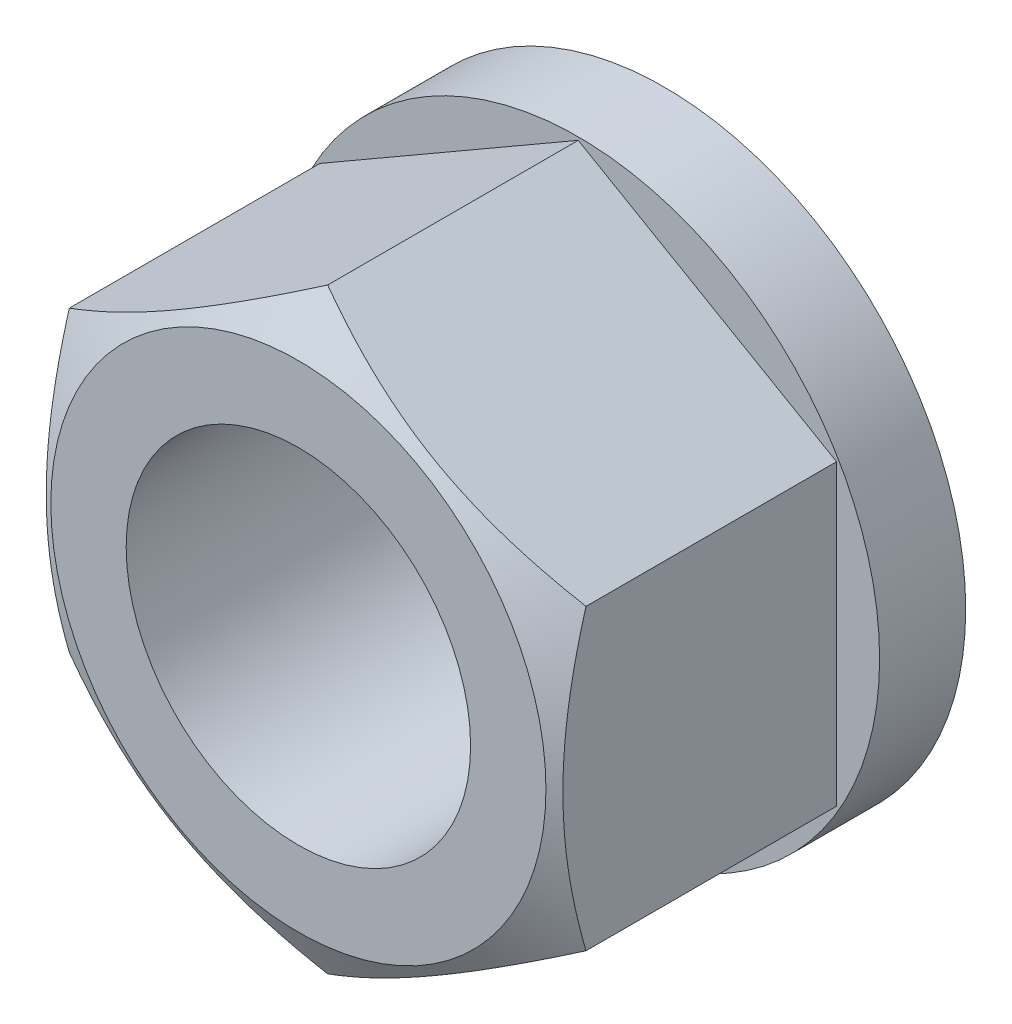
ISO-10303-21;
HEADER;
FILE_DESCRIPTION(('STEP AP214'),'2;1');
FILE_NAME('part.step','',(''),(''),'','','');
FILE_SCHEMA(('AUTOMOTIVE_DESIGN { 1 0 10303 214 1 1 1 1 }'));
ENDSEC;
DATA;
#1=APPLICATION_CONTEXT('core data for automotive mechanical design processes');
#2=APPLICATION_PROTOCOL_DEFINITION('international standard','automotive_design',2000,#1);
#3=PRODUCT_CONTEXT('',#1,'mechanical');
#4=PRODUCT('Part','Part','',(#3));
#5=PRODUCT_RELATED_PRODUCT_CATEGORY('part','',(#4));
#6=PRODUCT_DEFINITION_FORMATION('','',#4);
#7=PRODUCT_DEFINITION_CONTEXT('part definition',#1,'design');
#8=PRODUCT_DEFINITION('design','',#6,#7);
#9=PRODUCT_DEFINITION_SHAPE('','',#8);
#10=(LENGTH_UNIT() NAMED_UNIT(*) SI_UNIT(.MILLI.,.METRE.));
#11=(NAMED_UNIT(*) PLANE_ANGLE_UNIT() SI_UNIT($,.RADIAN.));
#12=(NAMED_UNIT(*) SI_UNIT($,.STERADIAN.) SOLID_ANGLE_UNIT());
#13=UNCERTAINTY_MEASURE_WITH_UNIT(LENGTH_MEASURE(1.E-05),#10,'distance_accuracy_value','');
#14=(GEOMETRIC_REPRESENTATION_CONTEXT(3) GLOBAL_UNCERTAINTY_ASSIGNED_CONTEXT((#13)) GLOBAL_UNIT_ASSIGNED_CONTEXT((#10,
#11,#12)) REPRESENTATION_CONTEXT('',''));
#15=CARTESIAN_POINT('',(0.,0.,0.));
#16=DIRECTION('',(0.,0.,1.));
#17=DIRECTION('',(1.,0.,0.));
#18=AXIS2_PLACEMENT_3D('',#15,#16,#17);
#19=CARTESIAN_POINT('',(0.,0.,4.));
#20=DIRECTION('',(0.,0.,1.));
#21=DIRECTION('',(1.,0.,0.));
#22=AXIS2_PLACEMENT_3D('',#19,#20,#21);
#23=PLANE('',#22);
#24=CARTESIAN_POINT('',(0.,0.,4.));
#25=DIRECTION('',(0.,0.,1.));
#26=DIRECTION('',(1.,0.,0.));
#27=AXIS2_PLACEMENT_3D('',#24,#25,#26);
#28=CIRCLE('',#27,14.);
#29=CARTESIAN_POINT('',(14.,0.,4.));
#30=VERTEX_POINT('',#29);
#31=EDGE_CURVE('E28',#30,#30,#28,.T.);
#32=ORIENTED_EDGE('',*,*,#31,.T.);
#33=EDGE_LOOP('',(#32));
#34=FACE_BOUND('',#33,.T.);
#35=DIRECTION('',(-0.866025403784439,-0.5,0.));
#36=VECTOR('',#35,1.);
#37=CARTESIAN_POINT('',(0.,13.856406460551,4.));
#38=LINE('',#37,#36);
#39=CARTESIAN_POINT('',(0.,13.856406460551,4.));
#40=VERTEX_POINT('',#39);
#41=CARTESIAN_POINT('',(-12.,6.92820323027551,4.));
#42=VERTEX_POINT('',#41);
#43=EDGE_CURVE('E145',#40,#42,#38,.T.);
#44=ORIENTED_EDGE('',*,*,#43,.F.);
#45=DIRECTION('',(-0.866025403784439,0.5,0.));
#46=VECTOR('',#45,1.);
#47=CARTESIAN_POINT('',(12.,6.92820323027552,4.));
#48=LINE('',#47,#46);
#49=CARTESIAN_POINT('',(12.,6.92820323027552,4.));
#50=VERTEX_POINT('',#49);
#51=EDGE_CURVE('E146',#50,#40,#48,.T.);
#52=ORIENTED_EDGE('',*,*,#51,.F.);
#53=DIRECTION('',(0.,1.,0.));
#54=VECTOR('',#53,1.);
#55=CARTESIAN_POINT('',(12.,-6.92820323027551,4.));
#56=LINE('',#55,#54);
#57=CARTESIAN_POINT('',(12.,-6.92820323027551,4.));
#58=VERTEX_POINT('',#57);
#59=EDGE_CURVE('E86',#58,#50,#56,.T.);
#60=ORIENTED_EDGE('',*,*,#59,.F.);
#61=DIRECTION('',(0.866025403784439,0.5,0.));
#62=VECTOR('',#61,1.);
#63=CARTESIAN_POINT('',(0.,-13.856406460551,4.));
#64=LINE('',#63,#62);
#65=CARTESIAN_POINT('',(0.,-13.856406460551,4.));
#66=VERTEX_POINT('',#65);
#67=EDGE_CURVE('E91',#66,#58,#64,.T.);
#68=ORIENTED_EDGE('',*,*,#67,.F.);
#69=DIRECTION('',(0.866025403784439,-0.5,0.));
#70=VECTOR('',#69,1.);
#71=CARTESIAN_POINT('',(-12.,-6.92820323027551,4.));
#72=LINE('',#71,#70);
#73=CARTESIAN_POINT('',(-12.,-6.92820323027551,4.));
#74=VERTEX_POINT('',#73);
#75=EDGE_CURVE('E153',#74,#66,#72,.T.);
#76=ORIENTED_EDGE('',*,*,#75,.F.);
#77=DIRECTION('',(0.,-1.,0.));
#78=VECTOR('',#77,1.);
#79=CARTESIAN_POINT('',(-12.,6.92820323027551,4.));
#80=LINE('',#79,#78);
#81=EDGE_CURVE('E149',#42,#74,#80,.T.);
#82=ORIENTED_EDGE('',*,*,#81,.F.);
#83=EDGE_LOOP('',(#44,#52,#60,#68,#76,#82));
#84=FACE_BOUND('',#83,.T.);
#85=ADVANCED_FACE('F14',(#34,#84),#23,.T.);
#86=CARTESIAN_POINT('',(0.,0.,0.));
#87=DIRECTION('',(0.,0.,1.));
#88=DIRECTION('',(1.,0.,0.));
#89=AXIS2_PLACEMENT_3D('',#86,#87,#88);
#90=PLANE('',#89);
#91=CARTESIAN_POINT('',(0.,0.,0.));
#92=DIRECTION('',(0.,0.,1.));
#93=DIRECTION('',(1.,0.,0.));
#94=AXIS2_PLACEMENT_3D('',#91,#92,#93);
#95=CIRCLE('',#94,14.);
#96=CARTESIAN_POINT('',(14.,0.,0.));
#97=VERTEX_POINT('',#96);
#98=EDGE_CURVE('E107',#97,#97,#95,.T.);
#99=ORIENTED_EDGE('',*,*,#98,.F.);
#100=EDGE_LOOP('',(#99));
#101=FACE_BOUND('',#100,.T.);
#102=CARTESIAN_POINT('',(0.,0.,0.));
#103=DIRECTION('',(0.,0.,1.));
#104=DIRECTION('',(1.,0.,0.));
#105=AXIS2_PLACEMENT_3D('',#102,#103,#104);
#106=CIRCLE('',#105,8.1);
#107=CARTESIAN_POINT('',(8.1,0.,0.));
#108=VERTEX_POINT('',#107);
#109=EDGE_CURVE('E104',#108,#108,#106,.T.);
#110=ORIENTED_EDGE('',*,*,#109,.T.);
#111=EDGE_LOOP('',(#110));
#112=FACE_BOUND('',#111,.T.);
#113=ADVANCED_FACE('F113',(#101,#112),#90,.F.);
#114=CARTESIAN_POINT('',(0.,0.,4.));
#115=DIRECTION('',(0.,0.,-1.));
#116=DIRECTION('',(-1.,0.,0.));
#117=AXIS2_PLACEMENT_3D('',#114,#115,#116);
#118=CYLINDRICAL_SURFACE('',#117,14.);
#119=ORIENTED_EDGE('',*,*,#31,.F.);
#120=EDGE_LOOP('',(#119));
#121=FACE_BOUND('',#120,.T.);
#122=ORIENTED_EDGE('',*,*,#98,.T.);
#123=EDGE_LOOP('',(#122));
#124=FACE_BOUND('',#123,.T.);
#125=ADVANCED_FACE('F16',(#121,#124),#118,.T.);
#126=CARTESIAN_POINT('',(0.,0.,4.));
#127=DIRECTION('',(0.,0.,-1.));
#128=DIRECTION('',(-1.,0.,0.));
#129=AXIS2_PLACEMENT_3D('',#126,#127,#128);
#130=CYLINDRICAL_SURFACE('',#129,8.1);
#131=CARTESIAN_POINT('',(0.,0.,4.));
#132=DIRECTION('',(0.,0.,1.));
#133=DIRECTION('',(1.,0.,0.));
#134=AXIS2_PLACEMENT_3D('',#131,#132,#133);
#135=CIRCLE('',#134,8.1);
#136=CARTESIAN_POINT('',(8.1,0.,4.));
#137=VERTEX_POINT('',#136);
#138=EDGE_CURVE('E101',#137,#137,#135,.T.);
#139=ORIENTED_EDGE('',*,*,#138,.T.);
#140=EDGE_LOOP('',(#139));
#141=FACE_BOUND('',#140,.T.);
#142=ORIENTED_EDGE('',*,*,#109,.F.);
#143=EDGE_LOOP('',(#142));
#144=FACE_BOUND('',#143,.T.);
#145=ADVANCED_FACE('F118',(#141,#144),#130,.F.);
#146=CARTESIAN_POINT('',(0.,13.856406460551,17.));
#147=DIRECTION('',(0.,0.,1.));
#148=DIRECTION('',(1.,0.,0.));
#149=AXIS2_PLACEMENT_3D('',#146,#147,#148);
#150=PLANE('',#149);
#151=CARTESIAN_POINT('',(0.,0.,17.));
#152=DIRECTION('',(0.,0.,-1.));
#153=DIRECTION('',(-1.,0.,0.));
#154=AXIS2_PLACEMENT_3D('',#151,#152,#153);
#155=CIRCLE('',#154,11.5);
#156=CARTESIAN_POINT('',(-11.5,0.,17.));
#157=VERTEX_POINT('',#156);
#158=EDGE_CURVE('E324',#157,#157,#155,.T.);
#159=ORIENTED_EDGE('',*,*,#158,.F.);
#160=EDGE_LOOP('',(#159));
#161=FACE_BOUND('',#160,.T.);
#162=CARTESIAN_POINT('',(0.,0.,17.));
#163=DIRECTION('',(0.,0.,1.));
#164=DIRECTION('',(1.,0.,0.));
#165=AXIS2_PLACEMENT_3D('',#162,#163,#164);
#166=CIRCLE('',#165,8.);
#167=CARTESIAN_POINT('',(8.,0.,17.));
#168=VERTEX_POINT('',#167);
#169=EDGE_CURVE('E155',#168,#168,#166,.T.);
#170=ORIENTED_EDGE('',*,*,#169,.F.);
#171=EDGE_LOOP('',(#170));
#172=FACE_BOUND('',#171,.T.);
#173=ADVANCED_FACE('F120',(#161,#172),#150,.T.);
#174=CARTESIAN_POINT('',(0.,13.856406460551,4.));
#175=DIRECTION('',(0.,0.,1.));
#176=DIRECTION('',(1.,0.,0.));
#177=AXIS2_PLACEMENT_3D('',#174,#175,#176);
#178=PLANE('',#177);
#179=ORIENTED_EDGE('',*,*,#138,.F.);
#180=EDGE_LOOP('',(#179));
#181=FACE_BOUND('',#180,.T.);
#182=CARTESIAN_POINT('',(0.,0.,4.));
#183=DIRECTION('',(0.,0.,1.));
#184=DIRECTION('',(1.,0.,0.));
#185=AXIS2_PLACEMENT_3D('',#182,#183,#184);
#186=CIRCLE('',#185,8.);
#187=CARTESIAN_POINT('',(8.,0.,4.));
#188=VERTEX_POINT('',#187);
#189=EDGE_CURVE('E81',#188,#188,#186,.T.);
#190=ORIENTED_EDGE('',*,*,#189,.T.);
#191=EDGE_LOOP('',(#190));
#192=FACE_BOUND('',#191,.T.);
#193=ADVANCED_FACE('F129',(#181,#192),#178,.F.);
#194=CARTESIAN_POINT('',(12.,6.92820323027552,17.));
#195=DIRECTION('',(-0.5,-0.866025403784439,0.));
#196=DIRECTION('',(0.866025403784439,-0.5,0.));
#197=AXIS2_PLACEMENT_3D('',#194,#195,#196);
#198=PLANE('',#197);
#199=DIRECTION('',(0.,0.,-1.));
#200=VECTOR('',#199,1.);
#201=CARTESIAN_POINT('',(0.,13.856406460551,17.));
#202=LINE('',#201,#200);
#203=CARTESIAN_POINT('',(0.,13.856406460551,15.6395280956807));
#204=VERTEX_POINT('',#203);
#205=EDGE_CURVE('E80',#204,#40,#202,.T.);
#206=ORIENTED_EDGE('',*,*,#205,.F.);
#207=CARTESIAN_POINT('',(-0.00019999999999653,13.8565219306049,15.6394614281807));
#208=CARTESIAN_POINT('',(0.263585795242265,13.7042251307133,15.7273752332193));
#209=CARTESIAN_POINT('',(0.528355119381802,13.5513604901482,15.8112988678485));
#210=CARTESIAN_POINT('',(1.06001701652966,13.244405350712,15.9700586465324));
#211=CARTESIAN_POINT('',(1.32691025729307,13.0903144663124,16.0448918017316));
#212=CARTESIAN_POINT('',(2.13189040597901,12.6255589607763,16.254307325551));
#213=CARTESIAN_POINT('',(2.6731550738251,12.3130596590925,16.3734216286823));
#214=CARTESIAN_POINT('',(3.483132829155,11.8454187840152,16.513093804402));
#215=CARTESIAN_POINT('',(3.74942610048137,11.6916742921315,16.5528810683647));
#216=CARTESIAN_POINT('',(4.28324559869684,11.3834734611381,16.6196014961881));
#217=CARTESIAN_POINT('',(4.55077184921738,11.2290171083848,16.6465344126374));
#218=CARTESIAN_POINT('',(5.08627036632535,10.9198468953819,16.6868562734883));
#219=CARTESIAN_POINT('',(5.35424172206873,10.7651335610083,16.7002613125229));
#220=CARTESIAN_POINT('',(5.89043273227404,10.4555635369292,16.713241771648));
#221=CARTESIAN_POINT('',(6.15865237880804,10.3007068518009,16.7128176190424));
#222=CARTESIAN_POINT('',(6.66008937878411,10.0112020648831,16.6991048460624));
#223=CARTESIAN_POINT('',(6.89334249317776,9.87653331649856,16.6874888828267));
#224=CARTESIAN_POINT('',(7.35931224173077,9.60750555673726,16.6540168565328));
#225=CARTESIAN_POINT('',(7.59202883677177,9.47314656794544,16.632160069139));
#226=CARTESIAN_POINT('',(8.05679907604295,9.20481134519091,16.5785874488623));
#227=CARTESIAN_POINT('',(8.28885201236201,9.07083551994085,16.5468634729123));
#228=CARTESIAN_POINT('',(8.75186996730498,8.8035119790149,16.4741130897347));
#229=CARTESIAN_POINT('',(8.98283491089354,8.67016430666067,16.433086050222));
#230=CARTESIAN_POINT('',(9.68394195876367,8.26537996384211,16.2950132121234));
#231=CARTESIAN_POINT('',(10.1520537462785,7.99511549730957,16.1841999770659));
#232=CARTESIAN_POINT('',(11.0812971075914,7.4586165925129,15.9326990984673));
#233=CARTESIAN_POINT('',(11.5424405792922,7.19237528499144,15.7920705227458));
#234=CARTESIAN_POINT('',(12.0002,6.92808776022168,15.6394614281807));
#235=B_SPLINE_CURVE_WITH_KNOTS('',3,(#207,#208,#209,#210,#211,#212,#213,#214,#215,#216,#217,
#218,#219,#220,#221,#222,#223,#224,#225,#226,#227,#228,#229,#230,#231,#232,#233,#234),
.UNSPECIFIED.,.F.,.F.,(4,2,2,2,2,2,2,2,2,2,2,2,2,4),(0.,0.951004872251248,1.90232158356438,
3.80900466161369,4.7389455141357,5.66890426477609,6.59775529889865,7.5265776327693,
8.33514643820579,9.14377244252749,9.95306755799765,10.7624176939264,12.4167102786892,
14.0677556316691),.UNSPECIFIED.);
#236=CARTESIAN_POINT('',(12.,6.92820323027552,15.6395280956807));
#237=VERTEX_POINT('',#236);
#238=EDGE_CURVE('E72',#204,#237,#235,.T.);
#239=ORIENTED_EDGE('',*,*,#238,.T.);
#240=DIRECTION('',(0.,0.,-1.));
#241=VECTOR('',#240,1.);
#242=CARTESIAN_POINT('',(12.,6.92820323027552,17.));
#243=LINE('',#242,#241);
#244=EDGE_CURVE('E79',#237,#50,#243,.T.);
#245=ORIENTED_EDGE('',*,*,#244,.T.);
#246=ORIENTED_EDGE('',*,*,#51,.T.);
#247=EDGE_LOOP('',(#206,#239,#245,#246));
#248=FACE_BOUND('',#247,.T.);
#249=ADVANCED_FACE('F77',(#248),#198,.F.);
#250=CARTESIAN_POINT('',(0.,13.856406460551,17.));
#251=DIRECTION('',(0.5,-0.866025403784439,0.));
#252=DIRECTION('',(0.866025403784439,0.5,0.));
#253=AXIS2_PLACEMENT_3D('',#250,#251,#252);
#254=PLANE('',#253);
#255=DIRECTION('',(0.,0.,-1.));
#256=VECTOR('',#255,1.);
#257=CARTESIAN_POINT('',(-12.,6.92820323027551,17.));
#258=LINE('',#257,#256);
#259=CARTESIAN_POINT('',(-12.,6.92820323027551,15.6395280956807));
#260=VERTEX_POINT('',#259);
#261=EDGE_CURVE('E98',#260,#42,#258,.T.);
#262=ORIENTED_EDGE('',*,*,#261,.F.);
#263=CARTESIAN_POINT('',(-12.0002,6.92808776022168,15.6394614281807));
#264=CARTESIAN_POINT('',(-11.7364142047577,7.08038456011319,15.7273752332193));
#265=CARTESIAN_POINT('',(-11.4716448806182,7.23324920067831,15.8112988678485));
#266=CARTESIAN_POINT('',(-10.9399829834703,7.54020434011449,15.9700586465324));
#267=CARTESIAN_POINT('',(-10.6730897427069,7.69429522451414,16.0448918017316));
#268=CARTESIAN_POINT('',(-9.86810959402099,8.15905073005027,16.254307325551));
#269=CARTESIAN_POINT('',(-9.3268449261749,8.47155003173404,16.3734216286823));
#270=CARTESIAN_POINT('',(-8.51686717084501,8.93919090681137,16.5130938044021));
#271=CARTESIAN_POINT('',(-8.25057389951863,9.09293539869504,16.5528810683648));
#272=CARTESIAN_POINT('',(-7.71675440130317,9.40113622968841,16.6196014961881));
#273=CARTESIAN_POINT('',(-7.44922815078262,9.55559258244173,16.6465344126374));
#274=CARTESIAN_POINT('',(-6.91372963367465,9.86476279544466,16.6868562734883));
#275=CARTESIAN_POINT('',(-6.64575827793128,10.0194761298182,16.7002613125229));
#276=CARTESIAN_POINT('',(-6.10956726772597,10.3290461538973,16.713241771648));
#277=CARTESIAN_POINT('',(-5.84134762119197,10.4839028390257,16.7128176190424));
#278=CARTESIAN_POINT('',(-5.3399106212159,10.7734076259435,16.6991048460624));
#279=CARTESIAN_POINT('',(-5.10665750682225,10.908076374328,16.6874888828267));
#280=CARTESIAN_POINT('',(-4.64068775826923,11.1771041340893,16.6540168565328));
#281=CARTESIAN_POINT('',(-4.40797116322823,11.3114631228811,16.632160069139));
#282=CARTESIAN_POINT('',(-3.94320092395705,11.5797983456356,16.5785874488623));
#283=CARTESIAN_POINT('',(-3.711147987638,11.7137741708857,16.5468634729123));
#284=CARTESIAN_POINT('',(-3.24813003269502,11.9810977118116,16.4741130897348));
#285=CARTESIAN_POINT('',(-3.01716508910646,12.1144453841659,16.433086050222));
#286=CARTESIAN_POINT('',(-2.31605804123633,12.5192297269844,16.2950132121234));
#287=CARTESIAN_POINT('',(-1.84794625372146,12.789494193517,16.1841999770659));
#288=CARTESIAN_POINT('',(-0.918702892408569,13.3259930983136,15.9326990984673));
#289=CARTESIAN_POINT('',(-0.457559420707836,13.5922344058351,15.7920705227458));
#290=CARTESIAN_POINT('',(0.000200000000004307,13.8565219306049,15.6394614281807));
#291=B_SPLINE_CURVE_WITH_KNOTS('',3,(#263,#264,#265,#266,#267,#268,#269,#270,#271,#272,#273,
#274,#275,#276,#277,#278,#279,#280,#281,#282,#283,#284,#285,#286,#287,#288,#289,#290),
.UNSPECIFIED.,.F.,.F.,(4,2,2,2,2,2,2,2,2,2,2,2,2,4),(0.,0.951004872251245,1.90232158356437,
3.80900466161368,4.7389455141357,5.66890426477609,6.59775529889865,7.5265776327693,
8.33514643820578,9.14377244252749,9.95306755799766,10.7624176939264,12.4167102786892,
14.0677556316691),.UNSPECIFIED.);
#292=EDGE_CURVE('E82',#260,#204,#291,.T.);
#293=ORIENTED_EDGE('',*,*,#292,.T.);
#294=ORIENTED_EDGE('',*,*,#205,.T.);
#295=ORIENTED_EDGE('',*,*,#43,.T.);
#296=EDGE_LOOP('',(#262,#293,#294,#295));
#297=FACE_BOUND('',#296,.T.);
#298=ADVANCED_FACE('F173',(#297),#254,.F.);
#299=CARTESIAN_POINT('',(-12.,6.92820323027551,17.));
#300=DIRECTION('',(1.,0.,0.));
#301=DIRECTION('',(0.,0.,-1.));
#302=AXIS2_PLACEMENT_3D('',#299,#300,#301);
#303=PLANE('',#302);
#304=DIRECTION('',(0.,0.,-1.));
#305=VECTOR('',#304,1.);
#306=CARTESIAN_POINT('',(-12.,-6.92820323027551,17.));
#307=LINE('',#306,#305);
#308=CARTESIAN_POINT('',(-12.,-6.92820323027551,15.6395280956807));
#309=VERTEX_POINT('',#308);
#310=EDGE_CURVE('E96',#309,#74,#307,.T.);
#311=ORIENTED_EDGE('',*,*,#310,.F.);
#312=CARTESIAN_POINT('',(-12.,-18.4044574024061,10.9545756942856));
#313=CARTESIAN_POINT('',(-12.,-18.1432473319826,11.0809020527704));
#314=CARTESIAN_POINT('',(-12.,-17.8817251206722,11.2065826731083));
#315=CARTESIAN_POINT('',(-12.,-17.3579911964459,11.4565057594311));
#316=CARTESIAN_POINT('',(-12.,-17.0957794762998,11.5807482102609));
#317=CARTESIAN_POINT('',(-12.,-16.3079394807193,11.9511323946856));
#318=CARTESIAN_POINT('',(-12.,-15.7811869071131,12.1948919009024));
#319=CARTESIAN_POINT('',(-12.,-14.7211205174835,12.6759012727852));
#320=CARTESIAN_POINT('',(-12.,-14.1877864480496,12.9131066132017));
#321=CARTESIAN_POINT('',(-12.,-13.1168041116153,13.3775347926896));
#322=CARTESIAN_POINT('',(-12.,-12.5791560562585,13.6047581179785));
#323=CARTESIAN_POINT('',(-12.,-11.4821667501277,14.0533304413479));
#324=CARTESIAN_POINT('',(-12.,-10.9226645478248,14.2742879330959));
#325=CARTESIAN_POINT('',(-12.,-9.79703482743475,14.6989773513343));
#326=CARTESIAN_POINT('',(-12.,-9.23090656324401,14.9027073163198));
#327=CARTESIAN_POINT('',(-12.,-8.09227086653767,15.2874394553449));
#328=CARTESIAN_POINT('',(-12.,-7.51977973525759,15.468489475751));
#329=CARTESIAN_POINT('',(-12.,-6.36653421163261,15.8019261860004));
#330=CARTESIAN_POINT('',(-12.,-5.78578255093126,15.9543221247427));
#331=CARTESIAN_POINT('',(-12.,-4.90996546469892,16.1553991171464));
#332=CARTESIAN_POINT('',(-12.,-4.61800930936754,16.2177121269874));
#333=CARTESIAN_POINT('',(-12.,-4.03214189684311,16.3324029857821));
#334=CARTESIAN_POINT('',(-12.,-3.73823068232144,16.3847810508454));
#335=CARTESIAN_POINT('',(-12.,-3.14866992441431,16.4786655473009));
#336=CARTESIAN_POINT('',(-12.,-2.85302039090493,16.5201720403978));
#337=CARTESIAN_POINT('',(-12.,-2.2603140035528,16.5914780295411));
#338=CARTESIAN_POINT('',(-12.,-1.96325720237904,16.6212779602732));
#339=CARTESIAN_POINT('',(-12.,-1.37193863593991,16.6682164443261));
#340=CARTESIAN_POINT('',(-12.,-1.07768933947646,16.6855111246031));
#341=CARTESIAN_POINT('',(-12.,-0.488724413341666,16.7076571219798));
#342=CARTESIAN_POINT('',(-12.,-0.19400879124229,16.7125086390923));
#343=CARTESIAN_POINT('',(-12.,0.395365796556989,16.7096534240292));
#344=CARTESIAN_POINT('',(-12.,0.690024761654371,16.7019465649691));
#345=CARTESIAN_POINT('',(-12.,1.27876239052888,16.6741588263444));
#346=CARTESIAN_POINT('',(-12.,1.5728410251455,16.6540773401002));
#347=CARTESIAN_POINT('',(-12.,2.28594486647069,16.5907963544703));
#348=CARTESIAN_POINT('',(-12.,2.70442708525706,16.5413740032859));
#349=CARTESIAN_POINT('',(-12.,3.53815097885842,16.4202128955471));
#350=CARTESIAN_POINT('',(-12.,3.95339217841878,16.3484709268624));
#351=CARTESIAN_POINT('',(-12.,4.78028468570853,16.1852231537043));
#352=CARTESIAN_POINT('',(-12.,5.19193279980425,16.0937013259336));
#353=CARTESIAN_POINT('',(-12.,6.01103494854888,15.8936742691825));
#354=CARTESIAN_POINT('',(-12.,6.41848905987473,15.7851693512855));
#355=CARTESIAN_POINT('',(-12.,7.23804493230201,15.5512724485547));
#356=CARTESIAN_POINT('',(-12.,7.65005621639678,15.4255656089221));
#357=CARTESIAN_POINT('',(-12.,8.47001850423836,15.1616082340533));
#358=CARTESIAN_POINT('',(-12.,8.87796948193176,15.023357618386));
#359=CARTESIAN_POINT('',(-12.,9.69002053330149,14.7364686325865));
#360=CARTESIAN_POINT('',(-12.,10.0941219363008,14.5878340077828));
#361=CARTESIAN_POINT('',(-12.,10.8990062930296,14.2818818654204));
#362=CARTESIAN_POINT('',(-12.,11.2997892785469,14.1245644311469));
#363=CARTESIAN_POINT('',(-12.,12.2150442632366,13.7556914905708));
#364=CARTESIAN_POINT('',(-12.,12.7285380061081,13.5417129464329));
#365=CARTESIAN_POINT('',(-12.,13.7514199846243,13.1041323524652));
#366=CARTESIAN_POINT('',(-12.,14.2608080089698,12.8805298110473));
#367=CARTESIAN_POINT('',(-12.,15.2762056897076,12.425549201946));
#368=CARTESIAN_POINT('',(-12.,15.7822146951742,12.1941696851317));
#369=CARTESIAN_POINT('',(-12.,16.7912989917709,11.725136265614));
#370=CARTESIAN_POINT('',(-12.,17.2943743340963,11.4874824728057));
#371=CARTESIAN_POINT('',(-12.,18.2985405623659,11.0067961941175));
#372=CARTESIAN_POINT('',(-12.,18.799629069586,10.763758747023));
#373=CARTESIAN_POINT('',(-12.,19.7997125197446,10.273415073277));
#374=CARTESIAN_POINT('',(-12.,20.2987074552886,10.026108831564));
#375=CARTESIAN_POINT('',(-12.,21.294859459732,9.52795978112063));
#376=CARTESIAN_POINT('',(-12.,21.7920167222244,9.27711735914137));
#377=CARTESIAN_POINT('',(-12.,22.7848044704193,8.77242755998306));
#378=CARTESIAN_POINT('',(-12.,23.2804349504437,8.51858017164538));
#379=CARTESIAN_POINT('',(-12.,24.6874547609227,7.79338256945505));
#380=CARTESIAN_POINT('',(-12.,25.5972762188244,7.31899028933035));
#381=CARTESIAN_POINT('',(-12.,27.4135289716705,6.36370961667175));
#382=CARTESIAN_POINT('',(-12.,28.3199601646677,5.88282103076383));
#383=CARTESIAN_POINT('',(-12.,30.1281333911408,4.91711035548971));
#384=CARTESIAN_POINT('',(-12.,31.0298813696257,4.43229938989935));
#385=CARTESIAN_POINT('',(-12.,32.3808885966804,3.70215136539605));
#386=CARTESIAN_POINT('',(-12.,32.8309444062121,3.45828599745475));
#387=CARTESIAN_POINT('',(-12.,33.7305767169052,2.96967435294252));
#388=CARTESIAN_POINT('',(-12.,34.1801532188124,2.7249280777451));
#389=CARTESIAN_POINT('',(-12.,34.6295166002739,2.47979101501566));
#390=B_SPLINE_CURVE_WITH_KNOTS('',3,(#312,#313,#314,#315,#316,#317,#318,#319,#320,#321,#322,
#323,#324,#325,#326,#327,#328,#329,#330,#331,#332,#333,#334,#335,#336,#337,#338,#339,#340,#341,
#342,#343,#344,#345,#346,#347,#348,#349,#350,#351,#352,#353,#354,#355,#356,#357,#358,#359,#360,
#361,#362,#363,#364,#365,#366,#367,#368,#369,#370,#371,#372,#373,#374,#375,#376,#377,#378,#379,
#380,#381,#382,#383,#384,#385,#386,#387,#388,#389),.UNSPECIFIED.,.F.,.F.,(4,2,2,2,2,2,2,2,2,2,2,
2,2,2,2,2,2,2,2,2,2,2,2,2,2,2,2,2,2,2,2,2,2,2,2,2,2,2,4),(0.,0.870458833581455,1.74092683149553,
3.48213133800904,5.23316695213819,6.98411717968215,8.7885569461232,10.5932018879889,
12.3939731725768,14.1941622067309,15.0896162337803,15.9850507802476,16.8804802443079,
17.775876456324,18.659891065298,19.5438914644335,20.4279007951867,21.3119534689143,
22.5754211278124,23.8390707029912,25.1037478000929,26.3684017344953,27.6604466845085,
28.9524999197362,30.2440895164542,31.5356667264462,33.204417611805,34.8732538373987,
36.542402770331,38.2115224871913,39.8822502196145,41.5529838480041,43.2235361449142,
44.8940946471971,47.9722703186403,51.050537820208,54.1219607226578,55.65759827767,
57.1932334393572),.UNSPECIFIED.);
#391=EDGE_CURVE('E172',#309,#260,#390,.T.);
#392=ORIENTED_EDGE('',*,*,#391,.T.);
#393=ORIENTED_EDGE('',*,*,#261,.T.);
#394=ORIENTED_EDGE('',*,*,#81,.T.);
#395=EDGE_LOOP('',(#311,#392,#393,#394));
#396=FACE_BOUND('',#395,.T.);
#397=ADVANCED_FACE('F171',(#396),#303,.F.);
#398=CARTESIAN_POINT('',(-12.,-6.92820323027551,17.));
#399=DIRECTION('',(0.5,0.866025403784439,0.));
#400=DIRECTION('',(-0.866025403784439,0.5,0.));
#401=AXIS2_PLACEMENT_3D('',#398,#399,#400);
#402=PLANE('',#401);
#403=DIRECTION('',(0.,0.,-1.));
#404=VECTOR('',#403,1.);
#405=CARTESIAN_POINT('',(0.,-13.856406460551,17.));
#406=LINE('',#405,#404);
#407=CARTESIAN_POINT('',(0.,-13.856406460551,15.6395280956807));
#408=VERTEX_POINT('',#407);
#409=EDGE_CURVE('E89',#408,#66,#406,.T.);
#410=ORIENTED_EDGE('',*,*,#409,.F.);
#411=CARTESIAN_POINT('',(0.000199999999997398,-13.8565219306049,15.6394614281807));
#412=CARTESIAN_POINT('',(-0.26358579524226,-13.7042251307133,15.7273752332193));
#413=CARTESIAN_POINT('',(-0.528355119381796,-13.5513604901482,15.8112988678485));
#414=CARTESIAN_POINT('',(-1.06001701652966,-13.244405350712,15.9700586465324));
#415=CARTESIAN_POINT('',(-1.32691025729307,-13.0903144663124,16.0448918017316));
#416=CARTESIAN_POINT('',(-2.13189040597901,-12.6255589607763,16.254307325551));
#417=CARTESIAN_POINT('',(-2.6731550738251,-12.3130596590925,16.3734216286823));
#418=CARTESIAN_POINT('',(-3.48313282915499,-11.8454187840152,16.5130938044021));
#419=CARTESIAN_POINT('',(-3.74942610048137,-11.6916742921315,16.5528810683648));
#420=CARTESIAN_POINT('',(-4.28324559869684,-11.3834734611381,16.6196014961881));
#421=CARTESIAN_POINT('',(-4.55077184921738,-11.2290171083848,16.6465344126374));
#422=CARTESIAN_POINT('',(-5.08627036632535,-10.9198468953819,16.6868562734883));
#423=CARTESIAN_POINT('',(-5.35424172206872,-10.7651335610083,16.7002613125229));
#424=CARTESIAN_POINT('',(-5.89043273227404,-10.4555635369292,16.713241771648));
#425=CARTESIAN_POINT('',(-6.15865237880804,-10.3007068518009,16.7128176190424));
#426=CARTESIAN_POINT('',(-6.66008937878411,-10.0112020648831,16.6991048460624));
#427=CARTESIAN_POINT('',(-6.89334249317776,-9.87653331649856,16.6874888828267));
#428=CARTESIAN_POINT('',(-7.35931224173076,-9.60750555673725,16.6540168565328));
#429=CARTESIAN_POINT('',(-7.59202883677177,-9.47314656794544,16.632160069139));
#430=CARTESIAN_POINT('',(-8.05679907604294,-9.2048113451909,16.5785874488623));
#431=CARTESIAN_POINT('',(-8.288852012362,-9.07083551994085,16.5468634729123));
#432=CARTESIAN_POINT('',(-8.75186996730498,-8.80351197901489,16.4741130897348));
#433=CARTESIAN_POINT('',(-8.98283491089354,-8.67016430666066,16.433086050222));
#434=CARTESIAN_POINT('',(-9.68394195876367,-8.2653799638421,16.2950132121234));
#435=CARTESIAN_POINT('',(-10.1520537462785,-7.99511549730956,16.1841999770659));
#436=CARTESIAN_POINT('',(-11.0812971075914,-7.45861659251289,15.9326990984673));
#437=CARTESIAN_POINT('',(-11.5424405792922,-7.19237528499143,15.7920705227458));
#438=CARTESIAN_POINT('',(-12.0002,-6.92808776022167,15.6394614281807));
#439=B_SPLINE_CURVE_WITH_KNOTS('',3,(#411,#412,#413,#414,#415,#416,#417,#418,#419,#420,#421,
#422,#423,#424,#425,#426,#427,#428,#429,#430,#431,#432,#433,#434,#435,#436,#437,#438),
.UNSPECIFIED.,.F.,.F.,(4,2,2,2,2,2,2,2,2,2,2,2,2,4),(0.,0.951004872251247,1.90232158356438,
3.80900466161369,4.7389455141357,5.66890426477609,6.59775529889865,7.5265776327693,
8.33514643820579,9.14377244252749,9.95306755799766,10.7624176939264,12.4167102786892,
14.0677556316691),.UNSPECIFIED.);
#440=EDGE_CURVE('E168',#408,#309,#439,.T.);
#441=ORIENTED_EDGE('',*,*,#440,.T.);
#442=ORIENTED_EDGE('',*,*,#310,.T.);
#443=ORIENTED_EDGE('',*,*,#75,.T.);
#444=EDGE_LOOP('',(#410,#441,#442,#443));
#445=FACE_BOUND('',#444,.T.);
#446=ADVANCED_FACE('F165',(#445),#402,.F.);
#447=CARTESIAN_POINT('',(0.,-13.856406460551,17.));
#448=DIRECTION('',(-0.5,0.866025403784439,0.));
#449=DIRECTION('',(-0.866025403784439,-0.5,0.));
#450=AXIS2_PLACEMENT_3D('',#447,#448,#449);
#451=PLANE('',#450);
#452=DIRECTION('',(0.,0.,-1.));
#453=VECTOR('',#452,1.);
#454=CARTESIAN_POINT('',(12.,-6.92820323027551,17.));
#455=LINE('',#454,#453);
#456=CARTESIAN_POINT('',(12.,-6.92820323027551,15.6395280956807));
#457=VERTEX_POINT('',#456);
#458=EDGE_CURVE('E41',#457,#58,#455,.T.);
#459=ORIENTED_EDGE('',*,*,#458,.F.);
#460=CARTESIAN_POINT('',(12.0002,-6.92808776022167,15.6394614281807));
#461=CARTESIAN_POINT('',(11.7364142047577,-7.08038456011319,15.7273752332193));
#462=CARTESIAN_POINT('',(11.4716448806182,-7.23324920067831,15.8112988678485));
#463=CARTESIAN_POINT('',(10.9399829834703,-7.54020434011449,15.9700586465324));
#464=CARTESIAN_POINT('',(10.6730897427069,-7.69429522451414,16.0448918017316));
#465=CARTESIAN_POINT('',(9.86810959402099,-8.15905073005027,16.254307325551));
#466=CARTESIAN_POINT('',(9.3268449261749,-8.47155003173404,16.3734216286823));
#467=CARTESIAN_POINT('',(8.51686717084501,-8.93919090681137,16.513093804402));
#468=CARTESIAN_POINT('',(8.25057389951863,-9.09293539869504,16.5528810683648));
#469=CARTESIAN_POINT('',(7.71675440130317,-9.40113622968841,16.6196014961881));
#470=CARTESIAN_POINT('',(7.44922815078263,-9.55559258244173,16.6465344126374));
#471=CARTESIAN_POINT('',(6.91372963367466,-9.86476279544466,16.6868562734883));
#472=CARTESIAN_POINT('',(6.64575827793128,-10.0194761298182,16.7002613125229));
#473=CARTESIAN_POINT('',(6.10956726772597,-10.3290461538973,16.713241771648));
#474=CARTESIAN_POINT('',(5.84134762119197,-10.4839028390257,16.7128176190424));
#475=CARTESIAN_POINT('',(5.3399106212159,-10.7734076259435,16.6991048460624));
#476=CARTESIAN_POINT('',(5.10665750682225,-10.908076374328,16.6874888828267));
#477=CARTESIAN_POINT('',(4.64068775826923,-11.1771041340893,16.6540168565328));
#478=CARTESIAN_POINT('',(4.40797116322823,-11.3114631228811,16.632160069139));
#479=CARTESIAN_POINT('',(3.94320092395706,-11.5797983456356,16.5785874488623));
#480=CARTESIAN_POINT('',(3.711147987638,-11.7137741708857,16.5468634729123));
#481=CARTESIAN_POINT('',(3.24813003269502,-11.9810977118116,16.4741130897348));
#482=CARTESIAN_POINT('',(3.01716508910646,-12.1144453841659,16.433086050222));
#483=CARTESIAN_POINT('',(2.31605804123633,-12.5192297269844,16.2950132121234));
#484=CARTESIAN_POINT('',(1.84794625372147,-12.789494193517,16.1841999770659));
#485=CARTESIAN_POINT('',(0.918702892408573,-13.3259930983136,15.9326990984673));
#486=CARTESIAN_POINT('',(0.457559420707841,-13.5922344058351,15.7920705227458));
#487=CARTESIAN_POINT('',(-0.000200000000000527,-13.8565219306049,15.6394614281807));
#488=B_SPLINE_CURVE_WITH_KNOTS('',3,(#460,#461,#462,#463,#464,#465,#466,#467,#468,#469,#470,
#471,#472,#473,#474,#475,#476,#477,#478,#479,#480,#481,#482,#483,#484,#485,#486,#487),
.UNSPECIFIED.,.F.,.F.,(4,2,2,2,2,2,2,2,2,2,2,2,2,4),(0.,0.951004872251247,1.90232158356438,
3.80900466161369,4.7389455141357,5.66890426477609,6.59775529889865,7.5265776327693,
8.33514643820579,9.1437724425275,9.95306755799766,10.7624176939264,12.4167102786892,
14.0677556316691),.UNSPECIFIED.);
#489=EDGE_CURVE('E35',#457,#408,#488,.T.);
#490=ORIENTED_EDGE('',*,*,#489,.T.);
#491=ORIENTED_EDGE('',*,*,#409,.T.);
#492=ORIENTED_EDGE('',*,*,#67,.T.);
#493=EDGE_LOOP('',(#459,#490,#491,#492));
#494=FACE_BOUND('',#493,.T.);
#495=ADVANCED_FACE('F162',(#494),#451,.F.);
#496=CARTESIAN_POINT('',(12.,-6.92820323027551,17.));
#497=DIRECTION('',(-1.,0.,0.));
#498=DIRECTION('',(0.,0.,1.));
#499=AXIS2_PLACEMENT_3D('',#496,#497,#498);
#500=PLANE('',#499);
#501=ORIENTED_EDGE('',*,*,#244,.F.);
#502=CARTESIAN_POINT('',(12.,-18.4044574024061,10.9545756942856));
#503=CARTESIAN_POINT('',(12.,-18.1432473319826,11.0809020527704));
#504=CARTESIAN_POINT('',(12.,-17.8817251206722,11.2065826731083));
#505=CARTESIAN_POINT('',(12.,-17.3579911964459,11.4565057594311));
#506=CARTESIAN_POINT('',(12.,-17.0957794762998,11.5807482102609));
#507=CARTESIAN_POINT('',(12.,-16.3079394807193,11.9511323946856));
#508=CARTESIAN_POINT('',(12.,-15.7811869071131,12.1948919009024));
#509=CARTESIAN_POINT('',(12.,-14.7211205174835,12.6759012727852));
#510=CARTESIAN_POINT('',(12.,-14.1877864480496,12.9131066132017));
#511=CARTESIAN_POINT('',(12.,-13.1168041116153,13.3775347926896));
#512=CARTESIAN_POINT('',(12.,-12.5791560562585,13.6047581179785));
#513=CARTESIAN_POINT('',(12.,-11.4821667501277,14.0533304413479));
#514=CARTESIAN_POINT('',(12.,-10.9226645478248,14.2742879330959));
#515=CARTESIAN_POINT('',(12.,-9.79703482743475,14.6989773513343));
#516=CARTESIAN_POINT('',(12.,-9.230906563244,14.9027073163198));
#517=CARTESIAN_POINT('',(12.,-8.09227086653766,15.2874394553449));
#518=CARTESIAN_POINT('',(12.,-7.51977973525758,15.4684894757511));
#519=CARTESIAN_POINT('',(12.,-6.36653421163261,15.8019261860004));
#520=CARTESIAN_POINT('',(12.,-5.78578255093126,15.9543221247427));
#521=CARTESIAN_POINT('',(12.,-4.90996546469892,16.1553991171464));
#522=CARTESIAN_POINT('',(12.,-4.61800930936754,16.2177121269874));
#523=CARTESIAN_POINT('',(12.,-4.03214189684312,16.3324029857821));
#524=CARTESIAN_POINT('',(12.,-3.73823068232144,16.3847810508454));
#525=CARTESIAN_POINT('',(12.,-3.14866992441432,16.4786655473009));
#526=CARTESIAN_POINT('',(12.,-2.85302039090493,16.5201720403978));
#527=CARTESIAN_POINT('',(12.,-2.26031400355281,16.5914780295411));
#528=CARTESIAN_POINT('',(12.,-1.96325720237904,16.6212779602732));
#529=CARTESIAN_POINT('',(12.,-1.37193863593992,16.668216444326));
#530=CARTESIAN_POINT('',(12.,-1.07768933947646,16.6855111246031));
#531=CARTESIAN_POINT('',(12.,-0.488724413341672,16.7076571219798));
#532=CARTESIAN_POINT('',(12.,-0.194008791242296,16.7125086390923));
#533=CARTESIAN_POINT('',(12.,0.395365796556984,16.7096534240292));
#534=CARTESIAN_POINT('',(12.,0.690024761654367,16.7019465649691));
#535=CARTESIAN_POINT('',(12.,1.27876239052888,16.6741588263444));
#536=CARTESIAN_POINT('',(12.,1.57284102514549,16.6540773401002));
#537=CARTESIAN_POINT('',(12.,2.28594486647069,16.5907963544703));
#538=CARTESIAN_POINT('',(12.,2.70442708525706,16.5413740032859));
#539=CARTESIAN_POINT('',(12.,3.53815097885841,16.4202128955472));
#540=CARTESIAN_POINT('',(12.,3.95339217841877,16.3484709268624));
#541=CARTESIAN_POINT('',(12.,4.78028468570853,16.1852231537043));
#542=CARTESIAN_POINT('',(12.,5.19193279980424,16.0937013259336));
#543=CARTESIAN_POINT('',(12.,6.01103494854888,15.8936742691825));
#544=CARTESIAN_POINT('',(12.,6.41848905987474,15.7851693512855));
#545=CARTESIAN_POINT('',(12.,7.23804493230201,15.5512724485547));
#546=CARTESIAN_POINT('',(12.,7.65005621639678,15.4255656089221));
#547=CARTESIAN_POINT('',(12.,8.47001850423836,15.1616082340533));
#548=CARTESIAN_POINT('',(12.,8.87796948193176,15.023357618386));
#549=CARTESIAN_POINT('',(12.,9.69002053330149,14.7364686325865));
#550=CARTESIAN_POINT('',(12.,10.0941219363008,14.5878340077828));
#551=CARTESIAN_POINT('',(12.,10.8990062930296,14.2818818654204));
#552=CARTESIAN_POINT('',(12.,11.2997892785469,14.1245644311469));
#553=CARTESIAN_POINT('',(12.,12.2150442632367,13.7556914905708));
#554=CARTESIAN_POINT('',(12.,12.7285380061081,13.5417129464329));
#555=CARTESIAN_POINT('',(12.,13.7514199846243,13.1041323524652));
#556=CARTESIAN_POINT('',(12.,14.2608080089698,12.8805298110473));
#557=CARTESIAN_POINT('',(12.,15.2762056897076,12.425549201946));
#558=CARTESIAN_POINT('',(12.,15.7822146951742,12.1941696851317));
#559=CARTESIAN_POINT('',(12.,16.7912989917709,11.725136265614));
#560=CARTESIAN_POINT('',(12.,17.2943743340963,11.4874824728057));
#561=CARTESIAN_POINT('',(12.,18.2985405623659,11.0067961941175));
#562=CARTESIAN_POINT('',(12.,18.799629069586,10.763758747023));
#563=CARTESIAN_POINT('',(12.,19.7997125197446,10.273415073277));
#564=CARTESIAN_POINT('',(12.,20.2987074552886,10.026108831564));
#565=CARTESIAN_POINT('',(12.,21.294859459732,9.52795978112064));
#566=CARTESIAN_POINT('',(12.,21.7920167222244,9.27711735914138));
#567=CARTESIAN_POINT('',(12.,22.7848044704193,8.77242755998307));
#568=CARTESIAN_POINT('',(12.,23.2804349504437,8.51858017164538));
#569=CARTESIAN_POINT('',(12.,24.6874547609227,7.79338256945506));
#570=CARTESIAN_POINT('',(12.,25.5972762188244,7.31899028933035));
#571=CARTESIAN_POINT('',(12.,27.4135289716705,6.36370961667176));
#572=CARTESIAN_POINT('',(12.,28.3199601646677,5.88282103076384));
#573=CARTESIAN_POINT('',(12.,30.1281333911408,4.91711035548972));
#574=CARTESIAN_POINT('',(12.,31.0298813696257,4.43229938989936));
#575=CARTESIAN_POINT('',(12.,32.3808885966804,3.70215136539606));
#576=CARTESIAN_POINT('',(12.,32.8309444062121,3.45828599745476));
#577=CARTESIAN_POINT('',(12.,33.7305767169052,2.96967435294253));
#578=CARTESIAN_POINT('',(12.,34.1801532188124,2.7249280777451));
#579=CARTESIAN_POINT('',(12.,34.6295166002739,2.47979101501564));
#580=B_SPLINE_CURVE_WITH_KNOTS('',3,(#502,#503,#504,#505,#506,#507,#508,#509,#510,#511,#512,
#513,#514,#515,#516,#517,#518,#519,#520,#521,#522,#523,#524,#525,#526,#527,#528,#529,#530,#531,
#532,#533,#534,#535,#536,#537,#538,#539,#540,#541,#542,#543,#544,#545,#546,#547,#548,#549,#550,
#551,#552,#553,#554,#555,#556,#557,#558,#559,#560,#561,#562,#563,#564,#565,#566,#567,#568,#569,
#570,#571,#572,#573,#574,#575,#576,#577,#578,#579),.UNSPECIFIED.,.F.,.F.,(4,2,2,2,2,2,2,2,2,2,2,
2,2,2,2,2,2,2,2,2,2,2,2,2,2,2,2,2,2,2,2,2,2,2,2,2,2,2,4),(0.,0.870458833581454,1.74092683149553,
3.48213133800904,5.2331669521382,6.98411717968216,8.78855694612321,10.5932018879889,
12.3939731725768,14.1941622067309,15.0896162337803,15.9850507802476,16.8804802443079,
17.775876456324,18.659891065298,19.5438914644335,20.4279007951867,21.3119534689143,
22.5754211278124,23.8390707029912,25.1037478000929,26.3684017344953,27.6604466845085,
28.9524999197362,30.2440895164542,31.5356667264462,33.204417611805,34.8732538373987,
36.542402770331,38.2115224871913,39.8822502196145,41.5529838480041,43.2235361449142,
44.8940946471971,47.9722703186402,51.050537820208,54.1219607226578,55.65759827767,
57.1932334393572),.UNSPECIFIED.);
#581=EDGE_CURVE('E9',#237,#457,#580,.F.);
#582=ORIENTED_EDGE('',*,*,#581,.T.);
#583=ORIENTED_EDGE('',*,*,#458,.T.);
#584=ORIENTED_EDGE('',*,*,#59,.T.);
#585=EDGE_LOOP('',(#501,#582,#583,#584));
#586=FACE_BOUND('',#585,.T.);
#587=ADVANCED_FACE('F84',(#586),#500,.F.);
#588=CARTESIAN_POINT('',(0.,0.,17.));
#589=DIRECTION('',(0.,0.,-1.));
#590=DIRECTION('',(-1.,0.,0.));
#591=AXIS2_PLACEMENT_3D('',#588,#589,#590);
#592=CYLINDRICAL_SURFACE('',#591,8.);
#593=ORIENTED_EDGE('',*,*,#169,.T.);
#594=EDGE_LOOP('',(#593));
#595=FACE_BOUND('',#594,.T.);
#596=ORIENTED_EDGE('',*,*,#189,.F.);
#597=EDGE_LOOP('',(#596));
#598=FACE_BOUND('',#597,.T.);
#599=ADVANCED_FACE('F196',(#595,#598),#592,.F.);
#600=CARTESIAN_POINT('',(0.,0.,17.));
#601=DIRECTION('',(0.,0.,-1.));
#602=DIRECTION('',(-1.,0.,0.));
#603=AXIS2_PLACEMENT_3D('',#600,#601,#602);
#604=CONICAL_SURFACE('',#603,11.5,1.0471975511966);
#605=ORIENTED_EDGE('',*,*,#158,.T.);
#606=EDGE_LOOP('',(#605));
#607=FACE_BOUND('',#606,.T.);
#608=ORIENTED_EDGE('',*,*,#292,.F.);
#609=ORIENTED_EDGE('',*,*,#391,.F.);
#610=ORIENTED_EDGE('',*,*,#440,.F.);
#611=ORIENTED_EDGE('',*,*,#489,.F.);
#612=ORIENTED_EDGE('',*,*,#581,.F.);
#613=ORIENTED_EDGE('',*,*,#238,.F.);
#614=EDGE_LOOP('',(#608,#609,#610,#611,#612,#613));
#615=FACE_BOUND('',#614,.T.);
#616=ADVANCED_FACE('F71',(#607,#615),#604,.T.);
#617=CLOSED_SHELL('',(#85,#113,#125,#145,#173,#193,#249,#298,#397,#446,#495,#587,#599,#616));
#618=MANIFOLD_SOLID_BREP('B1',#617);
#619=ADVANCED_BREP_SHAPE_REPRESENTATION('',(#18,#618),#14);
#620=SHAPE_DEFINITION_REPRESENTATION(#9,#619);
ENDSEC;
END-ISO-10303-21;
